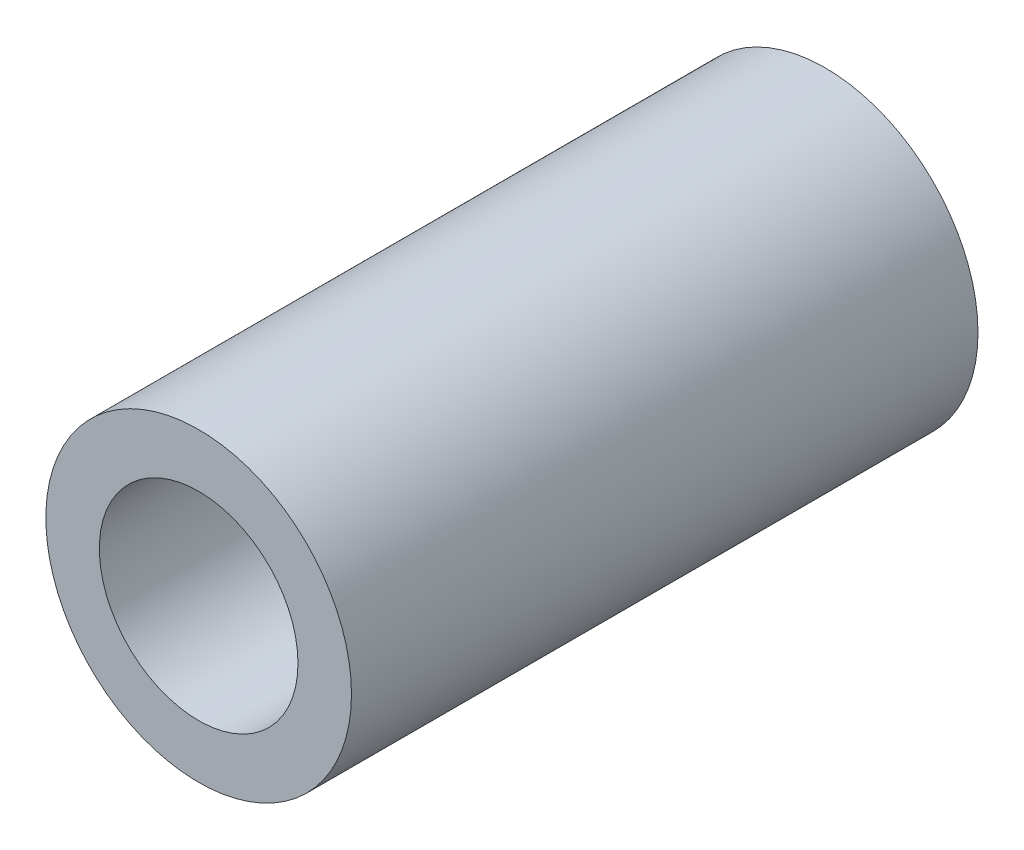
from build123d import *

# Parameters (mm, degrees)
SKETCH_1_R      = 5
SKETCH_1_R_2    = 3.25
EXTRUDE_1_DEPTH = 20.5


with BuildPart() as part:
    # Sketch 1 → Extrude 1 (new body)
    with BuildSketch(Plane.XY):
        Circle(SKETCH_1_R)
        Circle(SKETCH_1_R_2, mode=Mode.SUBTRACT)
    extrude(amount=EXTRUDE_1_DEPTH)


solid = part.part
